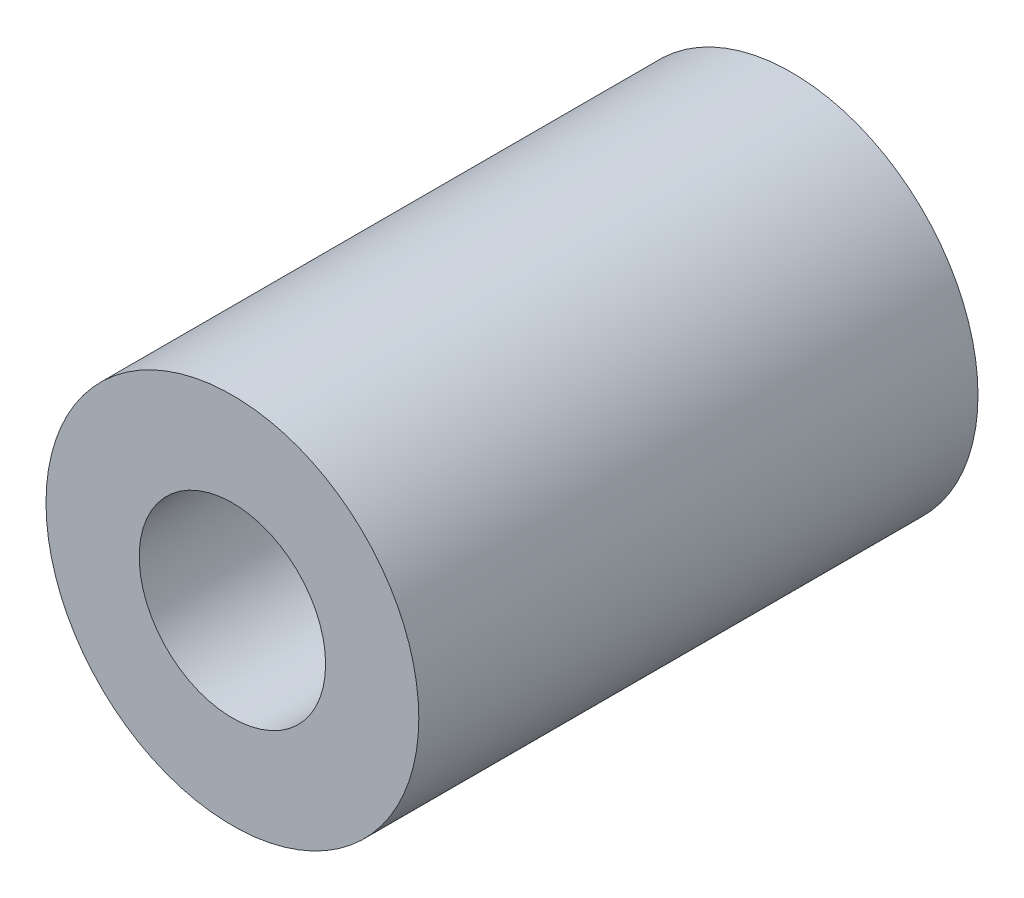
ISO-10303-21;
HEADER;
FILE_DESCRIPTION(('STEP AP214'),'2;1');
FILE_NAME('part.step','',(''),(''),'','','');
FILE_SCHEMA(('AUTOMOTIVE_DESIGN { 1 0 10303 214 1 1 1 1 }'));
ENDSEC;
DATA;
#1=APPLICATION_CONTEXT('core data for automotive mechanical design processes');
#2=APPLICATION_PROTOCOL_DEFINITION('international standard','automotive_design',2000,#1);
#3=PRODUCT_CONTEXT('',#1,'mechanical');
#4=PRODUCT('Part','Part','',(#3));
#5=PRODUCT_RELATED_PRODUCT_CATEGORY('part','',(#4));
#6=PRODUCT_DEFINITION_FORMATION('','',#4);
#7=PRODUCT_DEFINITION_CONTEXT('part definition',#1,'design');
#8=PRODUCT_DEFINITION('design','',#6,#7);
#9=PRODUCT_DEFINITION_SHAPE('','',#8);
#10=(LENGTH_UNIT() NAMED_UNIT(*) SI_UNIT(.MILLI.,.METRE.));
#11=(NAMED_UNIT(*) PLANE_ANGLE_UNIT() SI_UNIT($,.RADIAN.));
#12=(NAMED_UNIT(*) SI_UNIT($,.STERADIAN.) SOLID_ANGLE_UNIT());
#13=UNCERTAINTY_MEASURE_WITH_UNIT(LENGTH_MEASURE(1.E-05),#10,'distance_accuracy_value','');
#14=(GEOMETRIC_REPRESENTATION_CONTEXT(3) GLOBAL_UNCERTAINTY_ASSIGNED_CONTEXT((#13)) GLOBAL_UNIT_ASSIGNED_CONTEXT((#10,
#11,#12)) REPRESENTATION_CONTEXT('',''));
#15=CARTESIAN_POINT('',(0.,0.,0.));
#16=DIRECTION('',(0.,0.,1.));
#17=DIRECTION('',(1.,0.,0.));
#18=AXIS2_PLACEMENT_3D('',#15,#16,#17);
#19=CARTESIAN_POINT('',(0.,0.,30.));
#20=DIRECTION('',(0.,0.,-1.));
#21=DIRECTION('',(-1.,0.,0.));
#22=AXIS2_PLACEMENT_3D('',#19,#20,#21);
#23=CYLINDRICAL_SURFACE('',#22,10.);
#24=CARTESIAN_POINT('',(0.,0.,30.));
#25=DIRECTION('',(0.,0.,1.));
#26=DIRECTION('',(1.,0.,0.));
#27=AXIS2_PLACEMENT_3D('',#24,#25,#26);
#28=CIRCLE('',#27,10.);
#29=CARTESIAN_POINT('',(10.,0.,30.));
#30=VERTEX_POINT('',#29);
#31=EDGE_CURVE('E10',#30,#30,#28,.T.);
#32=ORIENTED_EDGE('',*,*,#31,.F.);
#33=EDGE_LOOP('',(#32));
#34=FACE_BOUND('',#33,.T.);
#35=CARTESIAN_POINT('',(0.,0.,0.));
#36=DIRECTION('',(0.,0.,1.));
#37=DIRECTION('',(1.,0.,0.));
#38=AXIS2_PLACEMENT_3D('',#35,#36,#37);
#39=CIRCLE('',#38,10.);
#40=CARTESIAN_POINT('',(10.,0.,0.));
#41=VERTEX_POINT('',#40);
#42=EDGE_CURVE('E38',#41,#41,#39,.T.);
#43=ORIENTED_EDGE('',*,*,#42,.T.);
#44=EDGE_LOOP('',(#43));
#45=FACE_BOUND('',#44,.T.);
#46=ADVANCED_FACE('F32',(#34,#45),#23,.T.);
#47=CARTESIAN_POINT('',(0.,0.,30.));
#48=DIRECTION('',(0.,0.,1.));
#49=DIRECTION('',(1.,0.,0.));
#50=AXIS2_PLACEMENT_3D('',#47,#48,#49);
#51=PLANE('',#50);
#52=CARTESIAN_POINT('',(0.,0.,30.));
#53=DIRECTION('',(0.,0.,1.));
#54=DIRECTION('',(1.,0.,0.));
#55=AXIS2_PLACEMENT_3D('',#52,#53,#54);
#56=CIRCLE('',#55,5.);
#57=CARTESIAN_POINT('',(5.,0.,30.));
#58=VERTEX_POINT('',#57);
#59=EDGE_CURVE('E46',#58,#58,#56,.T.);
#60=ORIENTED_EDGE('',*,*,#59,.F.);
#61=EDGE_LOOP('',(#60));
#62=FACE_BOUND('',#61,.T.);
#63=ORIENTED_EDGE('',*,*,#31,.T.);
#64=EDGE_LOOP('',(#63));
#65=FACE_BOUND('',#64,.T.);
#66=ADVANCED_FACE('F54',(#62,#65),#51,.T.);
#67=CARTESIAN_POINT('',(0.,0.,0.));
#68=DIRECTION('',(0.,0.,1.));
#69=DIRECTION('',(1.,0.,0.));
#70=AXIS2_PLACEMENT_3D('',#67,#68,#69);
#71=PLANE('',#70);
#72=CARTESIAN_POINT('',(0.,0.,0.));
#73=DIRECTION('',(0.,0.,1.));
#74=DIRECTION('',(1.,0.,0.));
#75=AXIS2_PLACEMENT_3D('',#72,#73,#74);
#76=CIRCLE('',#75,5.);
#77=CARTESIAN_POINT('',(5.,0.,0.));
#78=VERTEX_POINT('',#77);
#79=EDGE_CURVE('E42',#78,#78,#76,.T.);
#80=ORIENTED_EDGE('',*,*,#79,.T.);
#81=EDGE_LOOP('',(#80));
#82=FACE_BOUND('',#81,.T.);
#83=ORIENTED_EDGE('',*,*,#42,.F.);
#84=EDGE_LOOP('',(#83));
#85=FACE_BOUND('',#84,.T.);
#86=ADVANCED_FACE('F56',(#82,#85),#71,.F.);
#87=CARTESIAN_POINT('',(0.,0.,0.));
#88=DIRECTION('',(0.,0.,1.));
#89=DIRECTION('',(1.,0.,0.));
#90=AXIS2_PLACEMENT_3D('',#87,#88,#89);
#91=CYLINDRICAL_SURFACE('',#90,5.);
#92=ORIENTED_EDGE('',*,*,#79,.F.);
#93=EDGE_LOOP('',(#92));
#94=FACE_BOUND('',#93,.T.);
#95=ORIENTED_EDGE('',*,*,#59,.T.);
#96=EDGE_LOOP('',(#95));
#97=FACE_BOUND('',#96,.T.);
#98=ADVANCED_FACE('F52',(#94,#97),#91,.F.);
#99=CLOSED_SHELL('',(#46,#66,#86,#98));
#100=MANIFOLD_SOLID_BREP('B2',#99);
#101=ADVANCED_BREP_SHAPE_REPRESENTATION('',(#18,#100),#14);
#102=SHAPE_DEFINITION_REPRESENTATION(#9,#101);
ENDSEC;
END-ISO-10303-21;
